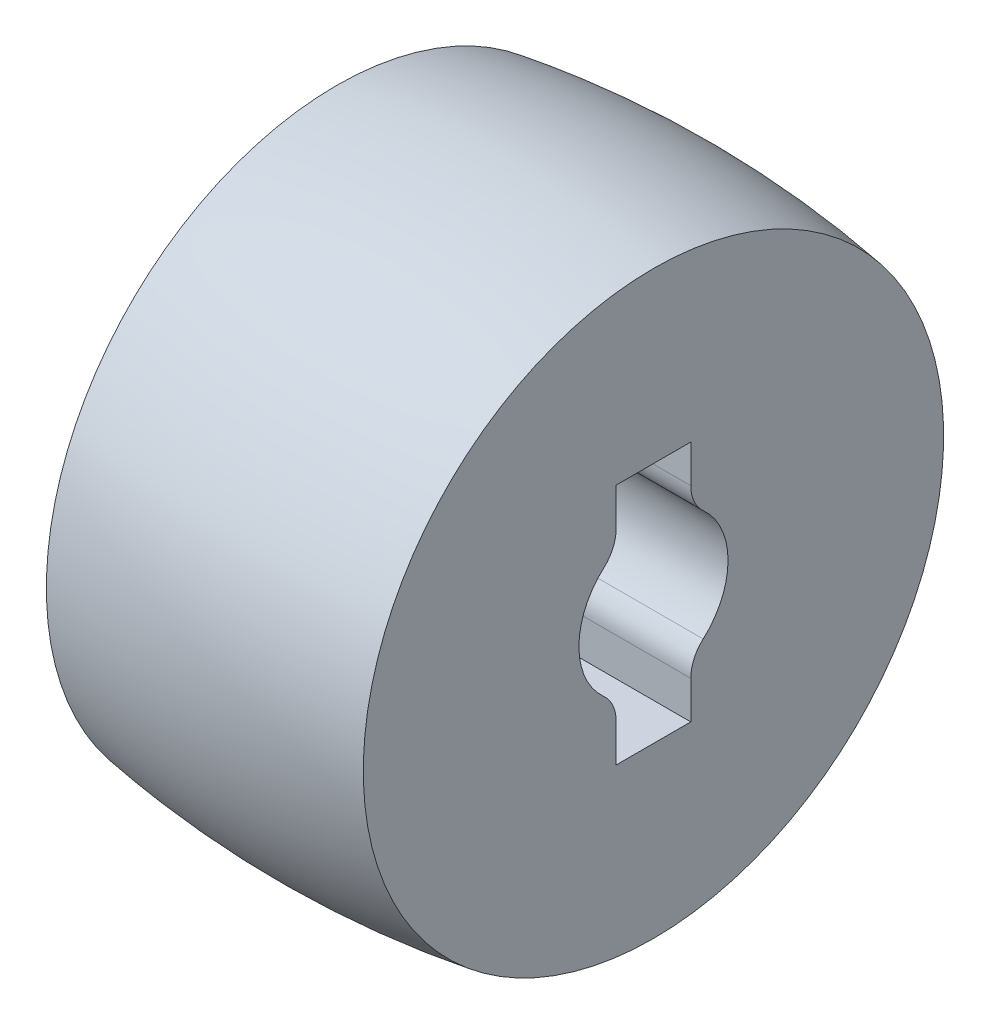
from build123d import *

# Parameters (mm, degrees)
CUT_EXTRUDE1_DEPTH      = 15.278886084
CUT_EXTRUDE1_DEPTH_BACK = 15.278886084
FILLET1_R               = 1


with BuildPart() as part:
    # Sketch1 → Revolve1 (revolve)
    with BuildSketch(Plane.XY):
        with BuildLine():
            Line((4.25, 0), (4.25, 7.782453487))
            ThreePointArc((4.25, 7.782453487), (0, 8.112847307), (-4.25, 7.782453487))
            Line((-4.25, 7.782453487), (-4.25, 0))
            Line((-4.25, 0), (4.25, 0))
        make_face()
    revolve(axis=Axis((19.503546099, 0, 0), (-1, 0, 0)))

    # Sketch2 → Cut-Extrude1 (cut, two sides: drawn at the far end of the back side and taken through both)
    with BuildSketch(Plane.ZY.offset(4.25).offset(-CUT_EXTRUDE1_DEPTH_BACK)):
        with BuildLine():
            ThreePointArc((1, 1.732050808), (0, 2), (-1, 1.732050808))
            Line((-1, 1.732050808), (-1, -1.732050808))
            ThreePointArc((-1, -1.732050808), (0, -2), (1, -1.732050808))
            Line((1, -1.732050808), (1, 1.732050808))
        make_face()
        with BuildLine():
            Line((1, 3.25), (-1, 3.25))
            Line((-1, 3.25), (-1, 1.732050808))
            ThreePointArc((-1, 1.732050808), (0, 2), (1, 1.732050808))
            Line((1, 1.732050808), (1, 3.25))
        make_face()
        with BuildLine():
            Line((-1, -1.732050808), (-1, 1.732050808))
            ThreePointArc((-1, 1.732050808), (-2, 0), (-1, -1.732050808))
        make_face()
        with BuildLine():
            ThreePointArc((2, 0), (1.732050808, 1), (1, 1.732050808))
            Line((1, 1.732050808), (1, -1.732050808))
            ThreePointArc((1, -1.732050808), (1.732050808, -1), (2, 0))
        make_face()
        with BuildLine():
            ThreePointArc((1, -1.732050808), (0, -2), (-1, -1.732050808))
            Line((-1, -1.732050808), (-1, -3.25))
            Line((-1, -3.25), (1, -3.25))
            Line((1, -3.25), (1, -1.732050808))
        make_face()
    extrude(amount=CUT_EXTRUDE1_DEPTH + CUT_EXTRUDE1_DEPTH_BACK, mode=Mode.SUBTRACT)

    # Fillet1
    fillet1_edges = [part.edges().sort_by_distance(p)[0] for p in [
        (0, -1.732050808, 1),
        (0, -1.732050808, -1),
        (0, 1.732050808, -1),
        (0, 1.732050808, 1),
    ]]
    fillet(fillet1_edges, radius=FILLET1_R)


solid = part.part
